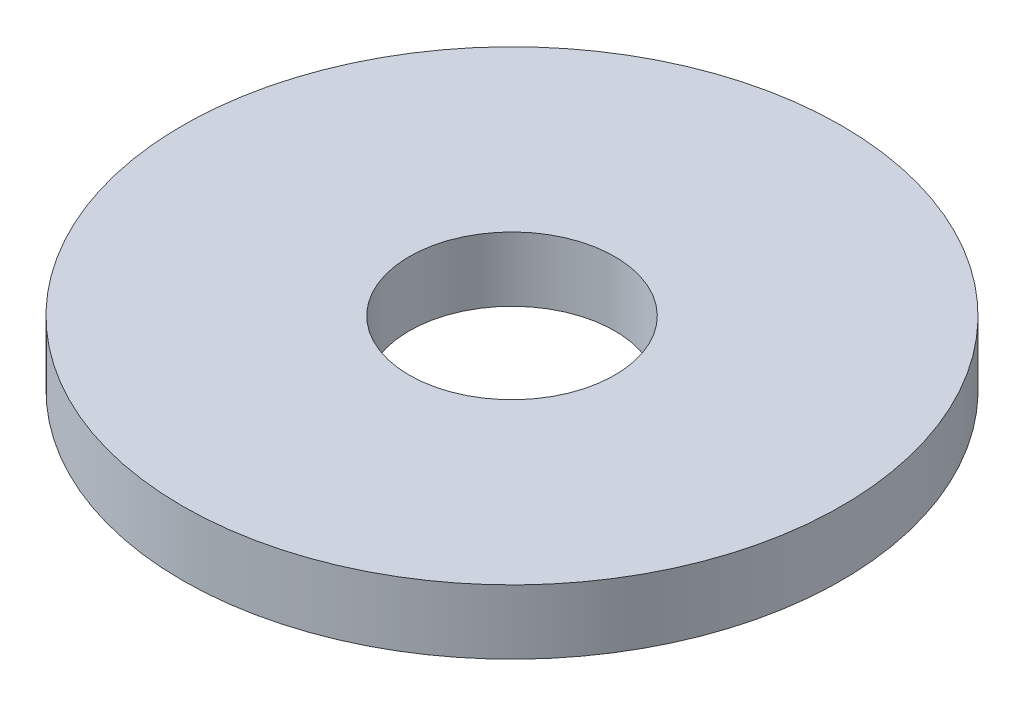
ISO-10303-21;
HEADER;
FILE_DESCRIPTION(('STEP AP214'),'2;1');
FILE_NAME('part.step','',(''),(''),'','','');
FILE_SCHEMA(('AUTOMOTIVE_DESIGN { 1 0 10303 214 1 1 1 1 }'));
ENDSEC;
DATA;
#1=APPLICATION_CONTEXT('core data for automotive mechanical design processes');
#2=APPLICATION_PROTOCOL_DEFINITION('international standard','automotive_design',2000,#1);
#3=PRODUCT_CONTEXT('',#1,'mechanical');
#4=PRODUCT('Part','Part','',(#3));
#5=PRODUCT_RELATED_PRODUCT_CATEGORY('part','',(#4));
#6=PRODUCT_DEFINITION_FORMATION('','',#4);
#7=PRODUCT_DEFINITION_CONTEXT('part definition',#1,'design');
#8=PRODUCT_DEFINITION('design','',#6,#7);
#9=PRODUCT_DEFINITION_SHAPE('','',#8);
#10=(LENGTH_UNIT() NAMED_UNIT(*) SI_UNIT(.MILLI.,.METRE.));
#11=(NAMED_UNIT(*) PLANE_ANGLE_UNIT() SI_UNIT($,.RADIAN.));
#12=(NAMED_UNIT(*) SI_UNIT($,.STERADIAN.) SOLID_ANGLE_UNIT());
#13=UNCERTAINTY_MEASURE_WITH_UNIT(LENGTH_MEASURE(1.E-05),#10,'distance_accuracy_value','');
#14=(GEOMETRIC_REPRESENTATION_CONTEXT(3) GLOBAL_UNCERTAINTY_ASSIGNED_CONTEXT((#13)) GLOBAL_UNIT_ASSIGNED_CONTEXT((#10,
#11,#12)) REPRESENTATION_CONTEXT('',''));
#15=CARTESIAN_POINT('',(0.,0.,0.));
#16=DIRECTION('',(0.,0.,1.));
#17=DIRECTION('',(1.,0.,0.));
#18=AXIS2_PLACEMENT_3D('',#15,#16,#17);
#19=CARTESIAN_POINT('',(0.,1.5748,0.));
#20=DIRECTION('',(0.,1.,0.));
#21=DIRECTION('',(0.,0.,1.));
#22=AXIS2_PLACEMENT_3D('',#19,#20,#21);
#23=PLANE('',#22);
#24=CARTESIAN_POINT('',(0.,1.5748,0.));
#25=DIRECTION('',(0.,1.,0.));
#26=DIRECTION('',(0.,0.,1.));
#27=AXIS2_PLACEMENT_3D('',#24,#25,#26);
#28=CIRCLE('',#27,8.0645);
#29=CARTESIAN_POINT('',(0.,1.5748,8.0645));
#30=VERTEX_POINT('',#29);
#31=EDGE_CURVE('E10',#30,#30,#28,.T.);
#32=ORIENTED_EDGE('',*,*,#31,.T.);
#33=EDGE_LOOP('',(#32));
#34=FACE_BOUND('',#33,.T.);
#35=CARTESIAN_POINT('',(0.,1.5748,0.));
#36=DIRECTION('',(0.,1.,0.));
#37=DIRECTION('',(0.,0.,1.));
#38=AXIS2_PLACEMENT_3D('',#35,#36,#37);
#39=CIRCLE('',#38,2.5146);
#40=CARTESIAN_POINT('',(0.,1.5748,2.5146));
#41=VERTEX_POINT('',#40);
#42=EDGE_CURVE('E44',#41,#41,#39,.T.);
#43=ORIENTED_EDGE('',*,*,#42,.F.);
#44=EDGE_LOOP('',(#43));
#45=FACE_BOUND('',#44,.T.);
#46=ADVANCED_FACE('F33',(#34,#45),#23,.T.);
#47=CARTESIAN_POINT('',(0.,0.,0.));
#48=DIRECTION('',(0.,1.,0.));
#49=DIRECTION('',(0.,0.,1.));
#50=AXIS2_PLACEMENT_3D('',#47,#48,#49);
#51=PLANE('',#50);
#52=CARTESIAN_POINT('',(0.,0.,0.));
#53=DIRECTION('',(0.,1.,0.));
#54=DIRECTION('',(0.,0.,1.));
#55=AXIS2_PLACEMENT_3D('',#52,#53,#54);
#56=CIRCLE('',#55,8.0645);
#57=CARTESIAN_POINT('',(0.,0.,8.0645));
#58=VERTEX_POINT('',#57);
#59=EDGE_CURVE('E37',#58,#58,#56,.T.);
#60=ORIENTED_EDGE('',*,*,#59,.F.);
#61=EDGE_LOOP('',(#60));
#62=FACE_BOUND('',#61,.T.);
#63=CARTESIAN_POINT('',(0.,0.,0.));
#64=DIRECTION('',(0.,1.,0.));
#65=DIRECTION('',(0.,0.,1.));
#66=AXIS2_PLACEMENT_3D('',#63,#64,#65);
#67=CIRCLE('',#66,2.5146);
#68=CARTESIAN_POINT('',(0.,0.,2.5146));
#69=VERTEX_POINT('',#68);
#70=EDGE_CURVE('E46',#69,#69,#67,.T.);
#71=ORIENTED_EDGE('',*,*,#70,.T.);
#72=EDGE_LOOP('',(#71));
#73=FACE_BOUND('',#72,.T.);
#74=ADVANCED_FACE('F56',(#62,#73),#51,.F.);
#75=CARTESIAN_POINT('',(0.,1.5748,0.));
#76=DIRECTION('',(0.,-1.,0.));
#77=DIRECTION('',(0.,0.,-1.));
#78=AXIS2_PLACEMENT_3D('',#75,#76,#77);
#79=CYLINDRICAL_SURFACE('',#78,8.0645);
#80=ORIENTED_EDGE('',*,*,#31,.F.);
#81=EDGE_LOOP('',(#80));
#82=FACE_BOUND('',#81,.T.);
#83=ORIENTED_EDGE('',*,*,#59,.T.);
#84=EDGE_LOOP('',(#83));
#85=FACE_BOUND('',#84,.T.);
#86=ADVANCED_FACE('F35',(#82,#85),#79,.T.);
#87=CARTESIAN_POINT('',(0.,1.5748,0.));
#88=DIRECTION('',(0.,-1.,0.));
#89=DIRECTION('',(0.,0.,-1.));
#90=AXIS2_PLACEMENT_3D('',#87,#88,#89);
#91=CYLINDRICAL_SURFACE('',#90,2.5146);
#92=ORIENTED_EDGE('',*,*,#42,.T.);
#93=EDGE_LOOP('',(#92));
#94=FACE_BOUND('',#93,.T.);
#95=ORIENTED_EDGE('',*,*,#70,.F.);
#96=EDGE_LOOP('',(#95));
#97=FACE_BOUND('',#96,.T.);
#98=ADVANCED_FACE('F52',(#94,#97),#91,.F.);
#99=CLOSED_SHELL('',(#46,#74,#86,#98));
#100=MANIFOLD_SOLID_BREP('B2',#99);
#101=ADVANCED_BREP_SHAPE_REPRESENTATION('',(#18,#100),#14);
#102=SHAPE_DEFINITION_REPRESENTATION(#9,#101);
ENDSEC;
END-ISO-10303-21;
